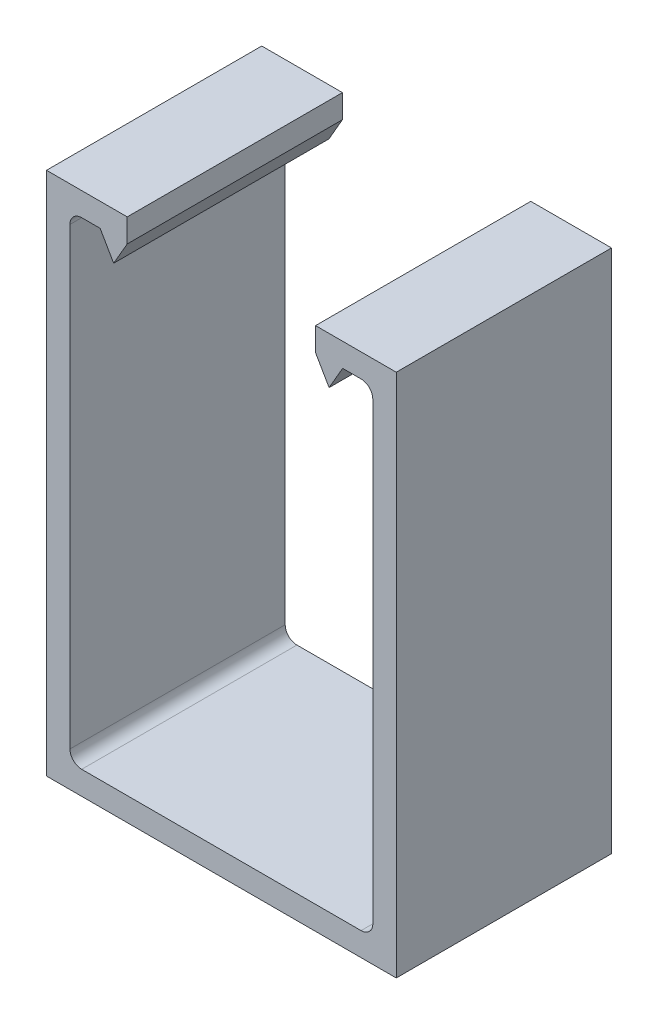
ISO-10303-21;
HEADER;
FILE_DESCRIPTION(('STEP AP214'),'2;1');
FILE_NAME('part.step','',(''),(''),'','','');
FILE_SCHEMA(('AUTOMOTIVE_DESIGN { 1 0 10303 214 1 1 1 1 }'));
ENDSEC;
DATA;
#1=APPLICATION_CONTEXT('core data for automotive mechanical design processes');
#2=APPLICATION_PROTOCOL_DEFINITION('international standard','automotive_design',2000,#1);
#3=PRODUCT_CONTEXT('',#1,'mechanical');
#4=PRODUCT('Part','Part','',(#3));
#5=PRODUCT_RELATED_PRODUCT_CATEGORY('part','',(#4));
#6=PRODUCT_DEFINITION_FORMATION('','',#4);
#7=PRODUCT_DEFINITION_CONTEXT('part definition',#1,'design');
#8=PRODUCT_DEFINITION('design','',#6,#7);
#9=PRODUCT_DEFINITION_SHAPE('','',#8);
#10=(LENGTH_UNIT() NAMED_UNIT(*) SI_UNIT(.MILLI.,.METRE.));
#11=(NAMED_UNIT(*) PLANE_ANGLE_UNIT() SI_UNIT($,.RADIAN.));
#12=(NAMED_UNIT(*) SI_UNIT($,.STERADIAN.) SOLID_ANGLE_UNIT());
#13=UNCERTAINTY_MEASURE_WITH_UNIT(LENGTH_MEASURE(1.E-05),#10,'distance_accuracy_value','');
#14=(GEOMETRIC_REPRESENTATION_CONTEXT(3) GLOBAL_UNCERTAINTY_ASSIGNED_CONTEXT((#13)) GLOBAL_UNIT_ASSIGNED_CONTEXT((#10,
#11,#12)) REPRESENTATION_CONTEXT('',''));
#15=CARTESIAN_POINT('',(0.,0.,0.));
#16=DIRECTION('',(0.,0.,1.));
#17=DIRECTION('',(1.,0.,0.));
#18=AXIS2_PLACEMENT_3D('',#15,#16,#17);
#19=CARTESIAN_POINT('',(-16.4846,-26.80335,12.7));
#20=DIRECTION('',(0.,0.,-1.));
#21=DIRECTION('',(-1.,0.,0.));
#22=AXIS2_PLACEMENT_3D('',#19,#20,#21);
#23=CYLINDRICAL_SURFACE('',#22,1.3843);
#24=CARTESIAN_POINT('',(-16.4846,-26.80335,-12.7));
#25=DIRECTION('',(0.,0.,-1.));
#26=DIRECTION('',(1.,0.,0.));
#27=AXIS2_PLACEMENT_3D('',#24,#25,#26);
#28=CIRCLE('',#27,1.3843);
#29=CARTESIAN_POINT('',(-16.4846,-28.18765,-12.7));
#30=VERTEX_POINT('',#29);
#31=CARTESIAN_POINT('',(-17.8689,-26.80335,-12.7));
#32=VERTEX_POINT('',#31);
#33=EDGE_CURVE('E201',#30,#32,#28,.T.);
#34=ORIENTED_EDGE('',*,*,#33,.T.);
#35=DIRECTION('',(0.,0.,-1.));
#36=VECTOR('',#35,1.);
#37=CARTESIAN_POINT('',(-17.8689,-26.80335,12.7));
#38=LINE('',#37,#36);
#39=CARTESIAN_POINT('',(-17.8689,-26.80335,12.7));
#40=VERTEX_POINT('',#39);
#41=EDGE_CURVE('E11',#40,#32,#38,.T.);
#42=ORIENTED_EDGE('',*,*,#41,.F.);
#43=CARTESIAN_POINT('',(-16.4846,-26.80335,12.7));
#44=DIRECTION('',(0.,0.,-1.));
#45=DIRECTION('',(1.,0.,0.));
#46=AXIS2_PLACEMENT_3D('',#43,#44,#45);
#47=CIRCLE('',#46,1.3843);
#48=CARTESIAN_POINT('',(-16.4846,-28.18765,12.7));
#49=VERTEX_POINT('',#48);
#50=EDGE_CURVE('E239',#49,#40,#47,.T.);
#51=ORIENTED_EDGE('',*,*,#50,.F.);
#52=DIRECTION('',(0.,0.,-1.));
#53=VECTOR('',#52,1.);
#54=CARTESIAN_POINT('',(-16.4846,-28.18765,12.7));
#55=LINE('',#54,#53);
#56=EDGE_CURVE('E197',#49,#30,#55,.T.);
#57=ORIENTED_EDGE('',*,*,#56,.T.);
#58=EDGE_LOOP('',(#34,#42,#51,#57));
#59=FACE_BOUND('',#58,.T.);
#60=ADVANCED_FACE('F33',(#59),#23,.F.);
#61=CARTESIAN_POINT('',(-17.8689,26.80335,12.7));
#62=DIRECTION('',(-1.,0.,0.));
#63=DIRECTION('',(0.,0.,1.));
#64=AXIS2_PLACEMENT_3D('',#61,#62,#63);
#65=PLANE('',#64);
#66=DIRECTION('',(0.,1.,0.));
#67=VECTOR('',#66,1.);
#68=CARTESIAN_POINT('',(-17.8689,26.80335,-12.7));
#69=LINE('',#68,#67);
#70=CARTESIAN_POINT('',(-17.8689,26.80335,-12.7));
#71=VERTEX_POINT('',#70);
#72=EDGE_CURVE('E204',#32,#71,#69,.T.);
#73=ORIENTED_EDGE('',*,*,#72,.T.);
#74=DIRECTION('',(0.,0.,-1.));
#75=VECTOR('',#74,1.);
#76=CARTESIAN_POINT('',(-17.8689,26.80335,12.7));
#77=LINE('',#76,#75);
#78=CARTESIAN_POINT('',(-17.8689,26.80335,12.7));
#79=VERTEX_POINT('',#78);
#80=EDGE_CURVE('E41',#79,#71,#77,.T.);
#81=ORIENTED_EDGE('',*,*,#80,.F.);
#82=DIRECTION('',(0.,1.,0.));
#83=VECTOR('',#82,1.);
#84=CARTESIAN_POINT('',(-17.8689,26.80335,12.7));
#85=LINE('',#84,#83);
#86=EDGE_CURVE('E128',#40,#79,#85,.T.);
#87=ORIENTED_EDGE('',*,*,#86,.F.);
#88=ORIENTED_EDGE('',*,*,#41,.T.);
#89=EDGE_LOOP('',(#73,#81,#87,#88));
#90=FACE_BOUND('',#89,.T.);
#91=ADVANCED_FACE('F357',(#90),#65,.F.);
#92=CARTESIAN_POINT('',(-16.4846,26.80335,12.7));
#93=DIRECTION('',(0.,0.,-1.));
#94=DIRECTION('',(-1.,0.,0.));
#95=AXIS2_PLACEMENT_3D('',#92,#93,#94);
#96=CYLINDRICAL_SURFACE('',#95,1.3843);
#97=CARTESIAN_POINT('',(-16.4846,26.80335,-12.7));
#98=DIRECTION('',(0.,0.,-1.));
#99=DIRECTION('',(1.,0.,0.));
#100=AXIS2_PLACEMENT_3D('',#97,#98,#99);
#101=CIRCLE('',#100,1.3843);
#102=CARTESIAN_POINT('',(-16.4846,28.18765,-12.7));
#103=VERTEX_POINT('',#102);
#104=EDGE_CURVE('E206',#71,#103,#101,.T.);
#105=ORIENTED_EDGE('',*,*,#104,.T.);
#106=DIRECTION('',(0.,0.,-1.));
#107=VECTOR('',#106,1.);
#108=CARTESIAN_POINT('',(-16.4846,28.18765,12.7));
#109=LINE('',#108,#107);
#110=CARTESIAN_POINT('',(-16.4846,28.18765,12.7));
#111=VERTEX_POINT('',#110);
#112=EDGE_CURVE('E282',#111,#103,#109,.T.);
#113=ORIENTED_EDGE('',*,*,#112,.F.);
#114=CARTESIAN_POINT('',(-16.4846,26.80335,12.7));
#115=DIRECTION('',(0.,0.,-1.));
#116=DIRECTION('',(1.,0.,0.));
#117=AXIS2_PLACEMENT_3D('',#114,#115,#116);
#118=CIRCLE('',#117,1.3843);
#119=EDGE_CURVE('E290',#79,#111,#118,.T.);
#120=ORIENTED_EDGE('',*,*,#119,.F.);
#121=ORIENTED_EDGE('',*,*,#80,.T.);
#122=EDGE_LOOP('',(#105,#113,#120,#121));
#123=FACE_BOUND('',#122,.T.);
#124=ADVANCED_FACE('F288',(#123),#96,.F.);
#125=CARTESIAN_POINT('',(-14.3094039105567,28.18765,12.7));
#126=DIRECTION('',(0.,1.,0.));
#127=DIRECTION('',(0.,0.,1.));
#128=AXIS2_PLACEMENT_3D('',#125,#126,#127);
#129=PLANE('',#128);
#130=DIRECTION('',(1.,0.,0.));
#131=VECTOR('',#130,1.);
#132=CARTESIAN_POINT('',(-14.3094039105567,28.18765,-12.7));
#133=LINE('',#132,#131);
#134=CARTESIAN_POINT('',(-14.3094039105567,28.18765,-12.7));
#135=VERTEX_POINT('',#134);
#136=EDGE_CURVE('E208',#103,#135,#133,.T.);
#137=ORIENTED_EDGE('',*,*,#136,.T.);
#138=DIRECTION('',(0.,0.,-1.));
#139=VECTOR('',#138,1.);
#140=CARTESIAN_POINT('',(-14.3094039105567,28.18765,12.7));
#141=LINE('',#140,#139);
#142=CARTESIAN_POINT('',(-14.3094039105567,28.18765,12.7));
#143=VERTEX_POINT('',#142);
#144=EDGE_CURVE('E279',#143,#135,#141,.T.);
#145=ORIENTED_EDGE('',*,*,#144,.F.);
#146=DIRECTION('',(1.,0.,0.));
#147=VECTOR('',#146,1.);
#148=CARTESIAN_POINT('',(-14.3094039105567,28.18765,12.7));
#149=LINE('',#148,#147);
#150=EDGE_CURVE('E308',#111,#143,#149,.T.);
#151=ORIENTED_EDGE('',*,*,#150,.F.);
#152=ORIENTED_EDGE('',*,*,#112,.T.);
#153=EDGE_LOOP('',(#137,#145,#151,#152));
#154=FACE_BOUND('',#153,.T.);
#155=ADVANCED_FACE('F299',(#154),#129,.F.);
#156=CARTESIAN_POINT('',(-14.3094039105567,28.18765,12.7));
#157=DIRECTION('',(0.866025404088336,0.499999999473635,0.));
#158=DIRECTION('',(-0.499999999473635,0.866025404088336,0.));
#159=AXIS2_PLACEMENT_3D('',#156,#157,#158);
#160=PLANE('',#159);
#161=DIRECTION('',(0.499999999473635,-0.866025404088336,0.));
#162=VECTOR('',#161,1.);
#163=CARTESIAN_POINT('',(-14.3094039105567,28.18765,-12.7));
#164=LINE('',#163,#162);
#165=CARTESIAN_POINT('',(-12.710951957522,25.41905,-12.7));
#166=VERTEX_POINT('',#165);
#167=EDGE_CURVE('E210',#135,#166,#164,.T.);
#168=ORIENTED_EDGE('',*,*,#167,.T.);
#169=DIRECTION('',(0.,0.,-1.));
#170=VECTOR('',#169,1.);
#171=CARTESIAN_POINT('',(-12.710951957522,25.41905,12.7));
#172=LINE('',#171,#170);
#173=CARTESIAN_POINT('',(-12.710951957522,25.41905,12.7));
#174=VERTEX_POINT('',#173);
#175=EDGE_CURVE('E276',#174,#166,#172,.T.);
#176=ORIENTED_EDGE('',*,*,#175,.F.);
#177=DIRECTION('',(0.499999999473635,-0.866025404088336,0.));
#178=VECTOR('',#177,1.);
#179=CARTESIAN_POINT('',(-14.3094039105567,28.18765,12.7));
#180=LINE('',#179,#178);
#181=EDGE_CURVE('E305',#143,#174,#180,.T.);
#182=ORIENTED_EDGE('',*,*,#181,.F.);
#183=ORIENTED_EDGE('',*,*,#144,.T.);
#184=EDGE_LOOP('',(#168,#176,#182,#183));
#185=FACE_BOUND('',#184,.T.);
#186=ADVANCED_FACE('F303',(#185),#160,.F.);
#187=CARTESIAN_POINT('',(-12.710951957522,25.41905,12.7));
#188=DIRECTION('',(-0.866025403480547,0.500000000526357,0.));
#189=DIRECTION('',(-0.500000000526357,-0.866025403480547,0.));
#190=AXIS2_PLACEMENT_3D('',#187,#188,#189);
#191=PLANE('',#190);
#192=DIRECTION('',(0.500000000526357,0.866025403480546,0.));
#193=VECTOR('',#192,1.);
#194=CARTESIAN_POINT('',(-12.710951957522,25.41905,-12.7));
#195=LINE('',#194,#193);
#196=CARTESIAN_POINT('',(-11.1125,28.18765,-12.7));
#197=VERTEX_POINT('',#196);
#198=EDGE_CURVE('E212',#166,#197,#195,.T.);
#199=ORIENTED_EDGE('',*,*,#198,.T.);
#200=DIRECTION('',(0.,0.,-1.));
#201=VECTOR('',#200,1.);
#202=CARTESIAN_POINT('',(-11.1125,28.18765,12.7));
#203=LINE('',#202,#201);
#204=CARTESIAN_POINT('',(-11.1125,28.18765,12.7));
#205=VERTEX_POINT('',#204);
#206=EDGE_CURVE('E273',#205,#197,#203,.T.);
#207=ORIENTED_EDGE('',*,*,#206,.F.);
#208=DIRECTION('',(0.500000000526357,0.866025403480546,0.));
#209=VECTOR('',#208,1.);
#210=CARTESIAN_POINT('',(-12.710951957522,25.41905,12.7));
#211=LINE('',#210,#209);
#212=EDGE_CURVE('E307',#174,#205,#211,.T.);
#213=ORIENTED_EDGE('',*,*,#212,.F.);
#214=ORIENTED_EDGE('',*,*,#175,.T.);
#215=EDGE_LOOP('',(#199,#207,#213,#214));
#216=FACE_BOUND('',#215,.T.);
#217=ADVANCED_FACE('F370',(#216),#191,.F.);
#218=CARTESIAN_POINT('',(-11.1125,28.18765,12.7));
#219=DIRECTION('',(-1.,0.,0.));
#220=DIRECTION('',(0.,-1.,0.));
#221=AXIS2_PLACEMENT_3D('',#218,#219,#220);
#222=PLANE('',#221);
#223=DIRECTION('',(0.,1.,0.));
#224=VECTOR('',#223,1.);
#225=CARTESIAN_POINT('',(-11.1125,28.18765,-12.7));
#226=LINE('',#225,#224);
#227=CARTESIAN_POINT('',(-11.1125,30.95625,-12.7));
#228=VERTEX_POINT('',#227);
#229=EDGE_CURVE('E214',#197,#228,#226,.T.);
#230=ORIENTED_EDGE('',*,*,#229,.T.);
#231=DIRECTION('',(0.,0.,-1.));
#232=VECTOR('',#231,1.);
#233=CARTESIAN_POINT('',(-11.1125,30.95625,12.7));
#234=LINE('',#233,#232);
#235=CARTESIAN_POINT('',(-11.1125,30.95625,12.7));
#236=VERTEX_POINT('',#235);
#237=EDGE_CURVE('E270',#236,#228,#234,.T.);
#238=ORIENTED_EDGE('',*,*,#237,.F.);
#239=DIRECTION('',(0.,1.,0.));
#240=VECTOR('',#239,1.);
#241=CARTESIAN_POINT('',(-11.1125,28.18765,12.7));
#242=LINE('',#241,#240);
#243=EDGE_CURVE('E310',#205,#236,#242,.T.);
#244=ORIENTED_EDGE('',*,*,#243,.F.);
#245=ORIENTED_EDGE('',*,*,#206,.T.);
#246=EDGE_LOOP('',(#230,#238,#244,#245));
#247=FACE_BOUND('',#246,.T.);
#248=ADVANCED_FACE('F373',(#247),#222,.F.);
#249=CARTESIAN_POINT('',(-11.1125,30.95625,12.7));
#250=DIRECTION('',(0.,-1.,0.));
#251=DIRECTION('',(0.,0.,-1.));
#252=AXIS2_PLACEMENT_3D('',#249,#250,#251);
#253=PLANE('',#252);
#254=DIRECTION('',(-1.,0.,0.));
#255=VECTOR('',#254,1.);
#256=CARTESIAN_POINT('',(-11.1125,30.95625,-12.7));
#257=LINE('',#256,#255);
#258=CARTESIAN_POINT('',(-20.6375,30.95625,-12.7));
#259=VERTEX_POINT('',#258);
#260=EDGE_CURVE('E216',#228,#259,#257,.T.);
#261=ORIENTED_EDGE('',*,*,#260,.T.);
#262=DIRECTION('',(0.,0.,-1.));
#263=VECTOR('',#262,1.);
#264=CARTESIAN_POINT('',(-20.6375,30.95625,12.7));
#265=LINE('',#264,#263);
#266=CARTESIAN_POINT('',(-20.6375,30.95625,12.7));
#267=VERTEX_POINT('',#266);
#268=EDGE_CURVE('E267',#267,#259,#265,.T.);
#269=ORIENTED_EDGE('',*,*,#268,.F.);
#270=DIRECTION('',(-1.,0.,0.));
#271=VECTOR('',#270,1.);
#272=CARTESIAN_POINT('',(-11.1125,30.95625,12.7));
#273=LINE('',#272,#271);
#274=EDGE_CURVE('E316',#236,#267,#273,.T.);
#275=ORIENTED_EDGE('',*,*,#274,.F.);
#276=ORIENTED_EDGE('',*,*,#237,.T.);
#277=EDGE_LOOP('',(#261,#269,#275,#276));
#278=FACE_BOUND('',#277,.T.);
#279=ADVANCED_FACE('F377',(#278),#253,.F.);
#280=CARTESIAN_POINT('',(-20.6375,30.95625,12.7));
#281=DIRECTION('',(1.,0.,0.));
#282=DIRECTION('',(0.,1.,0.));
#283=AXIS2_PLACEMENT_3D('',#280,#281,#282);
#284=PLANE('',#283);
#285=DIRECTION('',(0.,-1.,0.));
#286=VECTOR('',#285,1.);
#287=CARTESIAN_POINT('',(-20.6375,30.95625,-12.7));
#288=LINE('',#287,#286);
#289=CARTESIAN_POINT('',(-20.6375,-30.95625,-12.7));
#290=VERTEX_POINT('',#289);
#291=EDGE_CURVE('E218',#259,#290,#288,.T.);
#292=ORIENTED_EDGE('',*,*,#291,.T.);
#293=DIRECTION('',(0.,0.,-1.));
#294=VECTOR('',#293,1.);
#295=CARTESIAN_POINT('',(-20.6375,-30.95625,12.7));
#296=LINE('',#295,#294);
#297=CARTESIAN_POINT('',(-20.6375,-30.95625,12.7));
#298=VERTEX_POINT('',#297);
#299=EDGE_CURVE('E264',#298,#290,#296,.T.);
#300=ORIENTED_EDGE('',*,*,#299,.F.);
#301=DIRECTION('',(0.,-1.,0.));
#302=VECTOR('',#301,1.);
#303=CARTESIAN_POINT('',(-20.6375,30.95625,12.7));
#304=LINE('',#303,#302);
#305=EDGE_CURVE('E318',#267,#298,#304,.T.);
#306=ORIENTED_EDGE('',*,*,#305,.F.);
#307=ORIENTED_EDGE('',*,*,#268,.T.);
#308=EDGE_LOOP('',(#292,#300,#306,#307));
#309=FACE_BOUND('',#308,.T.);
#310=ADVANCED_FACE('F381',(#309),#284,.F.);
#311=CARTESIAN_POINT('',(-20.6375,-30.95625,12.7));
#312=DIRECTION('',(0.,1.,0.));
#313=DIRECTION('',(0.,0.,1.));
#314=AXIS2_PLACEMENT_3D('',#311,#312,#313);
#315=PLANE('',#314);
#316=DIRECTION('',(1.,0.,0.));
#317=VECTOR('',#316,1.);
#318=CARTESIAN_POINT('',(-20.6375,-30.95625,-12.7));
#319=LINE('',#318,#317);
#320=CARTESIAN_POINT('',(20.6375,-30.95625,-12.7));
#321=VERTEX_POINT('',#320);
#322=EDGE_CURVE('E220',#290,#321,#319,.T.);
#323=ORIENTED_EDGE('',*,*,#322,.T.);
#324=DIRECTION('',(0.,0.,-1.));
#325=VECTOR('',#324,1.);
#326=CARTESIAN_POINT('',(20.6375,-30.95625,12.7));
#327=LINE('',#326,#325);
#328=CARTESIAN_POINT('',(20.6375,-30.95625,12.7));
#329=VERTEX_POINT('',#328);
#330=EDGE_CURVE('E261',#329,#321,#327,.T.);
#331=ORIENTED_EDGE('',*,*,#330,.F.);
#332=DIRECTION('',(1.,0.,0.));
#333=VECTOR('',#332,1.);
#334=CARTESIAN_POINT('',(-20.6375,-30.95625,12.7));
#335=LINE('',#334,#333);
#336=EDGE_CURVE('E320',#298,#329,#335,.T.);
#337=ORIENTED_EDGE('',*,*,#336,.F.);
#338=ORIENTED_EDGE('',*,*,#299,.T.);
#339=EDGE_LOOP('',(#323,#331,#337,#338));
#340=FACE_BOUND('',#339,.T.);
#341=ADVANCED_FACE('F385',(#340),#315,.F.);
#342=CARTESIAN_POINT('',(20.6375,-30.95625,12.7));
#343=DIRECTION('',(-1.,0.,0.));
#344=DIRECTION('',(0.,0.,1.));
#345=AXIS2_PLACEMENT_3D('',#342,#343,#344);
#346=PLANE('',#345);
#347=DIRECTION('',(0.,1.,0.));
#348=VECTOR('',#347,1.);
#349=CARTESIAN_POINT('',(20.6375,-30.95625,-12.7));
#350=LINE('',#349,#348);
#351=CARTESIAN_POINT('',(20.6375,30.95625,-12.7));
#352=VERTEX_POINT('',#351);
#353=EDGE_CURVE('E222',#321,#352,#350,.T.);
#354=ORIENTED_EDGE('',*,*,#353,.T.);
#355=DIRECTION('',(0.,0.,-1.));
#356=VECTOR('',#355,1.);
#357=CARTESIAN_POINT('',(20.6375,30.95625,12.7));
#358=LINE('',#357,#356);
#359=CARTESIAN_POINT('',(20.6375,30.95625,12.7));
#360=VERTEX_POINT('',#359);
#361=EDGE_CURVE('E258',#360,#352,#358,.T.);
#362=ORIENTED_EDGE('',*,*,#361,.F.);
#363=DIRECTION('',(0.,1.,0.));
#364=VECTOR('',#363,1.);
#365=CARTESIAN_POINT('',(20.6375,-30.95625,12.7));
#366=LINE('',#365,#364);
#367=EDGE_CURVE('E322',#329,#360,#366,.T.);
#368=ORIENTED_EDGE('',*,*,#367,.F.);
#369=ORIENTED_EDGE('',*,*,#330,.T.);
#370=EDGE_LOOP('',(#354,#362,#368,#369));
#371=FACE_BOUND('',#370,.T.);
#372=ADVANCED_FACE('F389',(#371),#346,.F.);
#373=CARTESIAN_POINT('',(20.6375,30.95625,12.7));
#374=DIRECTION('',(0.,-1.,0.));
#375=DIRECTION('',(0.,0.,-1.));
#376=AXIS2_PLACEMENT_3D('',#373,#374,#375);
#377=PLANE('',#376);
#378=DIRECTION('',(-1.,0.,0.));
#379=VECTOR('',#378,1.);
#380=CARTESIAN_POINT('',(20.6375,30.95625,-12.7));
#381=LINE('',#380,#379);
#382=CARTESIAN_POINT('',(11.1125,30.95625,-12.7));
#383=VERTEX_POINT('',#382);
#384=EDGE_CURVE('E224',#352,#383,#381,.T.);
#385=ORIENTED_EDGE('',*,*,#384,.T.);
#386=DIRECTION('',(0.,0.,-1.));
#387=VECTOR('',#386,1.);
#388=CARTESIAN_POINT('',(11.1125,30.95625,12.7));
#389=LINE('',#388,#387);
#390=CARTESIAN_POINT('',(11.1125,30.95625,12.7));
#391=VERTEX_POINT('',#390);
#392=EDGE_CURVE('E255',#391,#383,#389,.T.);
#393=ORIENTED_EDGE('',*,*,#392,.F.);
#394=DIRECTION('',(-1.,0.,0.));
#395=VECTOR('',#394,1.);
#396=CARTESIAN_POINT('',(20.6375,30.95625,12.7));
#397=LINE('',#396,#395);
#398=EDGE_CURVE('E324',#360,#391,#397,.T.);
#399=ORIENTED_EDGE('',*,*,#398,.F.);
#400=ORIENTED_EDGE('',*,*,#361,.T.);
#401=EDGE_LOOP('',(#385,#393,#399,#400));
#402=FACE_BOUND('',#401,.T.);
#403=ADVANCED_FACE('F393',(#402),#377,.F.);
#404=CARTESIAN_POINT('',(11.1125,28.18765,12.7));
#405=DIRECTION('',(1.,0.,0.));
#406=DIRECTION('',(0.,0.,-1.));
#407=AXIS2_PLACEMENT_3D('',#404,#405,#406);
#408=PLANE('',#407);
#409=DIRECTION('',(0.,-1.,0.));
#410=VECTOR('',#409,1.);
#411=CARTESIAN_POINT('',(11.1125,28.18765,-12.7));
#412=LINE('',#411,#410);
#413=CARTESIAN_POINT('',(11.1125,28.18765,-12.7));
#414=VERTEX_POINT('',#413);
#415=EDGE_CURVE('E226',#383,#414,#412,.T.);
#416=ORIENTED_EDGE('',*,*,#415,.T.);
#417=DIRECTION('',(0.,0.,-1.));
#418=VECTOR('',#417,1.);
#419=CARTESIAN_POINT('',(11.1125,28.18765,12.7));
#420=LINE('',#419,#418);
#421=CARTESIAN_POINT('',(11.1125,28.18765,12.7));
#422=VERTEX_POINT('',#421);
#423=EDGE_CURVE('E252',#422,#414,#420,.T.);
#424=ORIENTED_EDGE('',*,*,#423,.F.);
#425=DIRECTION('',(0.,-1.,0.));
#426=VECTOR('',#425,1.);
#427=CARTESIAN_POINT('',(11.1125,28.18765,12.7));
#428=LINE('',#427,#426);
#429=EDGE_CURVE('E326',#391,#422,#428,.T.);
#430=ORIENTED_EDGE('',*,*,#429,.F.);
#431=ORIENTED_EDGE('',*,*,#392,.T.);
#432=EDGE_LOOP('',(#416,#424,#430,#431));
#433=FACE_BOUND('',#432,.T.);
#434=ADVANCED_FACE('F397',(#433),#408,.F.);
#435=CARTESIAN_POINT('',(12.710951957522,25.41905,12.7));
#436=DIRECTION('',(0.866025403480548,0.500000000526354,0.));
#437=DIRECTION('',(-0.500000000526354,0.866025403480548,0.));
#438=AXIS2_PLACEMENT_3D('',#435,#436,#437);
#439=PLANE('',#438);
#440=DIRECTION('',(0.500000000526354,-0.866025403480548,0.));
#441=VECTOR('',#440,1.);
#442=CARTESIAN_POINT('',(12.710951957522,25.41905,-12.7));
#443=LINE('',#442,#441);
#444=CARTESIAN_POINT('',(12.710951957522,25.41905,-12.7));
#445=VERTEX_POINT('',#444);
#446=EDGE_CURVE('E228',#414,#445,#443,.T.);
#447=ORIENTED_EDGE('',*,*,#446,.T.);
#448=DIRECTION('',(0.,0.,-1.));
#449=VECTOR('',#448,1.);
#450=CARTESIAN_POINT('',(12.710951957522,25.41905,12.7));
#451=LINE('',#450,#449);
#452=CARTESIAN_POINT('',(12.710951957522,25.41905,12.7));
#453=VERTEX_POINT('',#452);
#454=EDGE_CURVE('E249',#453,#445,#451,.T.);
#455=ORIENTED_EDGE('',*,*,#454,.F.);
#456=DIRECTION('',(0.500000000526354,-0.866025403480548,0.));
#457=VECTOR('',#456,1.);
#458=CARTESIAN_POINT('',(12.710951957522,25.41905,12.7));
#459=LINE('',#458,#457);
#460=EDGE_CURVE('E328',#422,#453,#459,.T.);
#461=ORIENTED_EDGE('',*,*,#460,.F.);
#462=ORIENTED_EDGE('',*,*,#423,.T.);
#463=EDGE_LOOP('',(#447,#455,#461,#462));
#464=FACE_BOUND('',#463,.T.);
#465=ADVANCED_FACE('F401',(#464),#439,.F.);
#466=CARTESIAN_POINT('',(14.3094039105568,28.18765,12.7));
#467=DIRECTION('',(-0.866025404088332,0.499999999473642,0.));
#468=DIRECTION('',(-0.499999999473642,-0.866025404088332,0.));
#469=AXIS2_PLACEMENT_3D('',#466,#467,#468);
#470=PLANE('',#469);
#471=DIRECTION('',(0.499999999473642,0.866025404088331,0.));
#472=VECTOR('',#471,1.);
#473=CARTESIAN_POINT('',(14.3094039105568,28.18765,-12.7));
#474=LINE('',#473,#472);
#475=CARTESIAN_POINT('',(14.3094039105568,28.18765,-12.7));
#476=VERTEX_POINT('',#475);
#477=EDGE_CURVE('E230',#445,#476,#474,.T.);
#478=ORIENTED_EDGE('',*,*,#477,.T.);
#479=DIRECTION('',(0.,0.,-1.));
#480=VECTOR('',#479,1.);
#481=CARTESIAN_POINT('',(14.3094039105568,28.18765,12.7));
#482=LINE('',#481,#480);
#483=CARTESIAN_POINT('',(14.3094039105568,28.18765,12.7));
#484=VERTEX_POINT('',#483);
#485=EDGE_CURVE('E246',#484,#476,#482,.T.);
#486=ORIENTED_EDGE('',*,*,#485,.F.);
#487=DIRECTION('',(0.499999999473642,0.866025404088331,0.));
#488=VECTOR('',#487,1.);
#489=CARTESIAN_POINT('',(14.3094039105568,28.18765,12.7));
#490=LINE('',#489,#488);
#491=EDGE_CURVE('E330',#453,#484,#490,.T.);
#492=ORIENTED_EDGE('',*,*,#491,.F.);
#493=ORIENTED_EDGE('',*,*,#454,.T.);
#494=EDGE_LOOP('',(#478,#486,#492,#493));
#495=FACE_BOUND('',#494,.T.);
#496=ADVANCED_FACE('F405',(#495),#470,.F.);
#497=CARTESIAN_POINT('',(16.4846,28.18765,12.7));
#498=DIRECTION('',(0.,1.,0.));
#499=DIRECTION('',(0.,0.,1.));
#500=AXIS2_PLACEMENT_3D('',#497,#498,#499);
#501=PLANE('',#500);
#502=DIRECTION('',(1.,0.,0.));
#503=VECTOR('',#502,1.);
#504=CARTESIAN_POINT('',(16.4846,28.18765,-12.7));
#505=LINE('',#504,#503);
#506=CARTESIAN_POINT('',(16.4846,28.18765,-12.7));
#507=VERTEX_POINT('',#506);
#508=EDGE_CURVE('E232',#476,#507,#505,.T.);
#509=ORIENTED_EDGE('',*,*,#508,.T.);
#510=DIRECTION('',(0.,0.,-1.));
#511=VECTOR('',#510,1.);
#512=CARTESIAN_POINT('',(16.4846,28.18765,12.7));
#513=LINE('',#512,#511);
#514=CARTESIAN_POINT('',(16.4846,28.18765,12.7));
#515=VERTEX_POINT('',#514);
#516=EDGE_CURVE('E243',#515,#507,#513,.T.);
#517=ORIENTED_EDGE('',*,*,#516,.F.);
#518=DIRECTION('',(1.,0.,0.));
#519=VECTOR('',#518,1.);
#520=CARTESIAN_POINT('',(16.4846,28.18765,12.7));
#521=LINE('',#520,#519);
#522=EDGE_CURVE('E332',#484,#515,#521,.T.);
#523=ORIENTED_EDGE('',*,*,#522,.F.);
#524=ORIENTED_EDGE('',*,*,#485,.T.);
#525=EDGE_LOOP('',(#509,#517,#523,#524));
#526=FACE_BOUND('',#525,.T.);
#527=ADVANCED_FACE('F338',(#526),#501,.F.);
#528=CARTESIAN_POINT('',(16.4846,26.80335,12.7));
#529=DIRECTION('',(0.,0.,-1.));
#530=DIRECTION('',(-1.,0.,0.));
#531=AXIS2_PLACEMENT_3D('',#528,#529,#530);
#532=CYLINDRICAL_SURFACE('',#531,1.3843);
#533=CARTESIAN_POINT('',(16.4846,26.80335,-12.7));
#534=DIRECTION('',(0.,0.,-1.));
#535=DIRECTION('',(1.,0.,0.));
#536=AXIS2_PLACEMENT_3D('',#533,#534,#535);
#537=CIRCLE('',#536,1.3843);
#538=CARTESIAN_POINT('',(17.8689,26.80335,-12.7));
#539=VERTEX_POINT('',#538);
#540=EDGE_CURVE('E234',#507,#539,#537,.T.);
#541=ORIENTED_EDGE('',*,*,#540,.T.);
#542=DIRECTION('',(0.,0.,-1.));
#543=VECTOR('',#542,1.);
#544=CARTESIAN_POINT('',(17.8689,26.80335,12.7));
#545=LINE('',#544,#543);
#546=CARTESIAN_POINT('',(17.8689,26.80335,12.7));
#547=VERTEX_POINT('',#546);
#548=EDGE_CURVE('E192',#547,#539,#545,.T.);
#549=ORIENTED_EDGE('',*,*,#548,.F.);
#550=CARTESIAN_POINT('',(16.4846,26.80335,12.7));
#551=DIRECTION('',(0.,0.,-1.));
#552=DIRECTION('',(1.,0.,0.));
#553=AXIS2_PLACEMENT_3D('',#550,#551,#552);
#554=CIRCLE('',#553,1.3843);
#555=EDGE_CURVE('E183',#515,#547,#554,.T.);
#556=ORIENTED_EDGE('',*,*,#555,.F.);
#557=ORIENTED_EDGE('',*,*,#516,.T.);
#558=EDGE_LOOP('',(#541,#549,#556,#557));
#559=FACE_BOUND('',#558,.T.);
#560=ADVANCED_FACE('F342',(#559),#532,.F.);
#561=CARTESIAN_POINT('',(17.8689,-26.80335,12.7));
#562=DIRECTION('',(1.,0.,0.));
#563=DIRECTION('',(0.,0.,-1.));
#564=AXIS2_PLACEMENT_3D('',#561,#562,#563);
#565=PLANE('',#564);
#566=DIRECTION('',(0.,-1.,0.));
#567=VECTOR('',#566,1.);
#568=CARTESIAN_POINT('',(17.8689,-26.80335,-12.7));
#569=LINE('',#568,#567);
#570=CARTESIAN_POINT('',(17.8689,-26.80335,-12.7));
#571=VERTEX_POINT('',#570);
#572=EDGE_CURVE('E191',#539,#571,#569,.T.);
#573=ORIENTED_EDGE('',*,*,#572,.T.);
#574=DIRECTION('',(0.,0.,-1.));
#575=VECTOR('',#574,1.);
#576=CARTESIAN_POINT('',(17.8689,-26.80335,12.7));
#577=LINE('',#576,#575);
#578=CARTESIAN_POINT('',(17.8689,-26.80335,12.7));
#579=VERTEX_POINT('',#578);
#580=EDGE_CURVE('E188',#579,#571,#577,.T.);
#581=ORIENTED_EDGE('',*,*,#580,.F.);
#582=DIRECTION('',(0.,-1.,0.));
#583=VECTOR('',#582,1.);
#584=CARTESIAN_POINT('',(17.8689,-26.80335,12.7));
#585=LINE('',#584,#583);
#586=EDGE_CURVE('E177',#547,#579,#585,.T.);
#587=ORIENTED_EDGE('',*,*,#586,.F.);
#588=ORIENTED_EDGE('',*,*,#548,.T.);
#589=EDGE_LOOP('',(#573,#581,#587,#588));
#590=FACE_BOUND('',#589,.T.);
#591=ADVANCED_FACE('F189',(#590),#565,.F.);
#592=CARTESIAN_POINT('',(16.4846,-26.80335,12.7));
#593=DIRECTION('',(0.,0.,-1.));
#594=DIRECTION('',(-1.,0.,0.));
#595=AXIS2_PLACEMENT_3D('',#592,#593,#594);
#596=CYLINDRICAL_SURFACE('',#595,1.3843);
#597=CARTESIAN_POINT('',(16.4846,-26.80335,-12.7));
#598=DIRECTION('',(0.,0.,-1.));
#599=DIRECTION('',(1.,0.,0.));
#600=AXIS2_PLACEMENT_3D('',#597,#598,#599);
#601=CIRCLE('',#600,1.3843);
#602=CARTESIAN_POINT('',(16.4846,-28.18765,-12.7));
#603=VERTEX_POINT('',#602);
#604=EDGE_CURVE('E114',#571,#603,#601,.T.);
#605=ORIENTED_EDGE('',*,*,#604,.T.);
#606=DIRECTION('',(0.,0.,-1.));
#607=VECTOR('',#606,1.);
#608=CARTESIAN_POINT('',(16.4846,-28.18765,12.7));
#609=LINE('',#608,#607);
#610=CARTESIAN_POINT('',(16.4846,-28.18765,12.7));
#611=VERTEX_POINT('',#610);
#612=EDGE_CURVE('E193',#611,#603,#609,.T.);
#613=ORIENTED_EDGE('',*,*,#612,.F.);
#614=CARTESIAN_POINT('',(16.4846,-26.80335,12.7));
#615=DIRECTION('',(0.,0.,-1.));
#616=DIRECTION('',(1.,0.,0.));
#617=AXIS2_PLACEMENT_3D('',#614,#615,#616);
#618=CIRCLE('',#617,1.3843);
#619=EDGE_CURVE('E181',#579,#611,#618,.T.);
#620=ORIENTED_EDGE('',*,*,#619,.F.);
#621=ORIENTED_EDGE('',*,*,#580,.T.);
#622=EDGE_LOOP('',(#605,#613,#620,#621));
#623=FACE_BOUND('',#622,.T.);
#624=ADVANCED_FACE('F195',(#623),#596,.F.);
#625=CARTESIAN_POINT('',(-16.4846,-28.18765,12.7));
#626=DIRECTION('',(0.,-1.,0.));
#627=DIRECTION('',(0.,0.,-1.));
#628=AXIS2_PLACEMENT_3D('',#625,#626,#627);
#629=PLANE('',#628);
#630=DIRECTION('',(-1.,0.,0.));
#631=VECTOR('',#630,1.);
#632=CARTESIAN_POINT('',(-16.4846,-28.18765,-12.7));
#633=LINE('',#632,#631);
#634=EDGE_CURVE('E120',#603,#30,#633,.T.);
#635=ORIENTED_EDGE('',*,*,#634,.T.);
#636=ORIENTED_EDGE('',*,*,#56,.F.);
#637=DIRECTION('',(-1.,0.,0.));
#638=VECTOR('',#637,1.);
#639=CARTESIAN_POINT('',(-16.4846,-28.18765,12.7));
#640=LINE('',#639,#638);
#641=EDGE_CURVE('E49',#611,#49,#640,.T.);
#642=ORIENTED_EDGE('',*,*,#641,.F.);
#643=ORIENTED_EDGE('',*,*,#612,.T.);
#644=EDGE_LOOP('',(#635,#636,#642,#643));
#645=FACE_BOUND('',#644,.T.);
#646=ADVANCED_FACE('F346',(#645),#629,.F.);
#647=CARTESIAN_POINT('',(-16.4846,-26.80335,12.7));
#648=DIRECTION('',(0.,0.,1.));
#649=DIRECTION('',(1.,0.,0.));
#650=AXIS2_PLACEMENT_3D('',#647,#648,#649);
#651=PLANE('',#650);
#652=ORIENTED_EDGE('',*,*,#50,.T.);
#653=ORIENTED_EDGE('',*,*,#86,.T.);
#654=ORIENTED_EDGE('',*,*,#119,.T.);
#655=ORIENTED_EDGE('',*,*,#150,.T.);
#656=ORIENTED_EDGE('',*,*,#181,.T.);
#657=ORIENTED_EDGE('',*,*,#212,.T.);
#658=ORIENTED_EDGE('',*,*,#243,.T.);
#659=ORIENTED_EDGE('',*,*,#274,.T.);
#660=ORIENTED_EDGE('',*,*,#305,.T.);
#661=ORIENTED_EDGE('',*,*,#336,.T.);
#662=ORIENTED_EDGE('',*,*,#367,.T.);
#663=ORIENTED_EDGE('',*,*,#398,.T.);
#664=ORIENTED_EDGE('',*,*,#429,.T.);
#665=ORIENTED_EDGE('',*,*,#460,.T.);
#666=ORIENTED_EDGE('',*,*,#491,.T.);
#667=ORIENTED_EDGE('',*,*,#522,.T.);
#668=ORIENTED_EDGE('',*,*,#555,.T.);
#669=ORIENTED_EDGE('',*,*,#586,.T.);
#670=ORIENTED_EDGE('',*,*,#619,.T.);
#671=ORIENTED_EDGE('',*,*,#641,.T.);
#672=EDGE_LOOP('',(#652,#653,#654,#655,#656,#657,#658,#659,#660,#661,#662,#663,#664,#665,#666,
#667,#668,#669,#670,#671));
#673=FACE_BOUND('',#672,.T.);
#674=ADVANCED_FACE('F179',(#673),#651,.T.);
#675=CARTESIAN_POINT('',(-16.4846,-26.80335,-12.7));
#676=DIRECTION('',(0.,0.,1.));
#677=DIRECTION('',(1.,0.,0.));
#678=AXIS2_PLACEMENT_3D('',#675,#676,#677);
#679=PLANE('',#678);
#680=ORIENTED_EDGE('',*,*,#33,.F.);
#681=ORIENTED_EDGE('',*,*,#634,.F.);
#682=ORIENTED_EDGE('',*,*,#604,.F.);
#683=ORIENTED_EDGE('',*,*,#572,.F.);
#684=ORIENTED_EDGE('',*,*,#540,.F.);
#685=ORIENTED_EDGE('',*,*,#508,.F.);
#686=ORIENTED_EDGE('',*,*,#477,.F.);
#687=ORIENTED_EDGE('',*,*,#446,.F.);
#688=ORIENTED_EDGE('',*,*,#415,.F.);
#689=ORIENTED_EDGE('',*,*,#384,.F.);
#690=ORIENTED_EDGE('',*,*,#353,.F.);
#691=ORIENTED_EDGE('',*,*,#322,.F.);
#692=ORIENTED_EDGE('',*,*,#291,.F.);
#693=ORIENTED_EDGE('',*,*,#260,.F.);
#694=ORIENTED_EDGE('',*,*,#229,.F.);
#695=ORIENTED_EDGE('',*,*,#198,.F.);
#696=ORIENTED_EDGE('',*,*,#167,.F.);
#697=ORIENTED_EDGE('',*,*,#136,.F.);
#698=ORIENTED_EDGE('',*,*,#104,.F.);
#699=ORIENTED_EDGE('',*,*,#72,.F.);
#700=EDGE_LOOP('',(#680,#681,#682,#683,#684,#685,#686,#687,#688,#689,#690,#691,#692,#693,#694,
#695,#696,#697,#698,#699));
#701=FACE_BOUND('',#700,.T.);
#702=ADVANCED_FACE('F294',(#701),#679,.F.);
#703=CLOSED_SHELL('',(#60,#91,#124,#155,#186,#217,#248,#279,#310,#341,#372,#403,#434,#465,#496,
#527,#560,#591,#624,#646,#674,#702));
#704=MANIFOLD_SOLID_BREP('B2',#703);
#705=ADVANCED_BREP_SHAPE_REPRESENTATION('',(#18,#704),#14);
#706=SHAPE_DEFINITION_REPRESENTATION(#9,#705);
ENDSEC;
END-ISO-10303-21;
